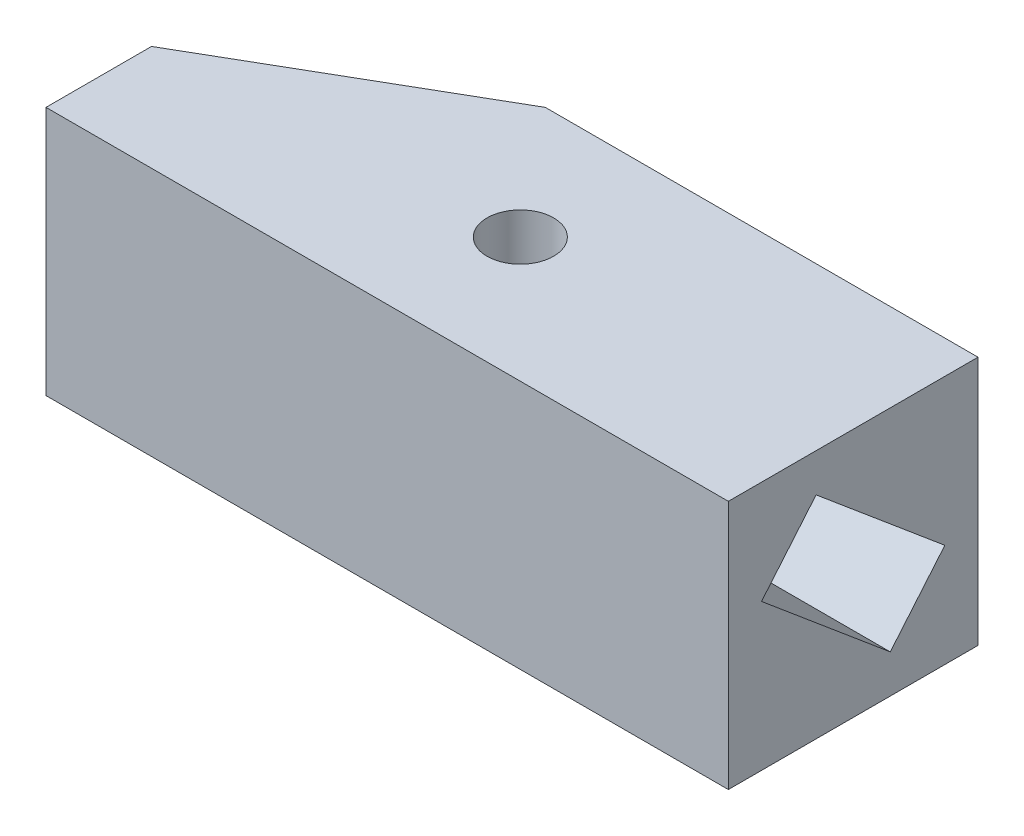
from build123d import *

# Parameters (mm, degrees)
EXTRUDE_1_DEPTH     = 30
SKETCH_2_R          = 4
CUT_EXTRUDE_1_DEPTH = 49.476798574
CUT_EXTRUDE_4_DEPTH = 25
SKETCH1_W           = 30
SKETCH1_H           = 30
BOSS_EXTRUDE1_DEPTH = 27
CHAMFER1_SIZE       = 30
CHAMFER1_SIZE2      = 17.320508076


with BuildPart() as part:
    # Sketch 1 → Extrude 1 (new body)
    with BuildSketch(Plane(origin=(0, 0, 0), x_dir=(1, 0, 0), z_dir=(0, 1, 0))):
        Polygon((-20, -15), (-35, -15), (-35, 15), (-20, 15), (20, 15), (20, -15), align=None)
    extrude(amount=EXTRUDE_1_DEPTH)

    # Sketch 2 → Cut-Extrude 1 (cut, through all)
    with BuildSketch(Plane(origin=(0, 30, 0), x_dir=(1, 0, 0), z_dir=(0, 1, 0))):
        with Locations(Location((-20, 0, 0), (0, 0, 270))):
            Circle(SKETCH_2_R)
    extrude(amount=-CUT_EXTRUDE_1_DEPTH, mode=Mode.SUBTRACT)

    # Sketch 5 → Cut-Extrude 4 (cut)
    with BuildSketch(Plane(origin=(20, 0, 0), x_dir=(0, 0, -1), z_dir=(1, 0, 0))):
        Polygon((4.458832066, 4.601018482), (11.015265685, 12.414671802), (-4.458832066, 25.398981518), (-11.015265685, 17.585328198), align=None)
    extrude(amount=-CUT_EXTRUDE_4_DEPTH, mode=Mode.SUBTRACT)

    # Sketch1 → Boss-Extrude1 (add)
    with BuildSketch(Plane.ZY.offset(35)):
        with Locations((0, 15)):
            Rectangle(SKETCH1_W, SKETCH1_H)
    extrude(amount=BOSS_EXTRUDE1_DEPTH)

    # Chamfer1
    chamfer1_edges = [part.edges().sort_by_distance(p)[0] for p in [
        (-62, 15, -15),
    ]]
    chamfer1_side = [part.faces().sort_by_distance(p)[0] for p in [
        (-21, 15, -15),
    ]]
    chamfer(chamfer1_edges, length=CHAMFER1_SIZE, length2=CHAMFER1_SIZE2, reference=chamfer1_side[0])


solid = part.part
